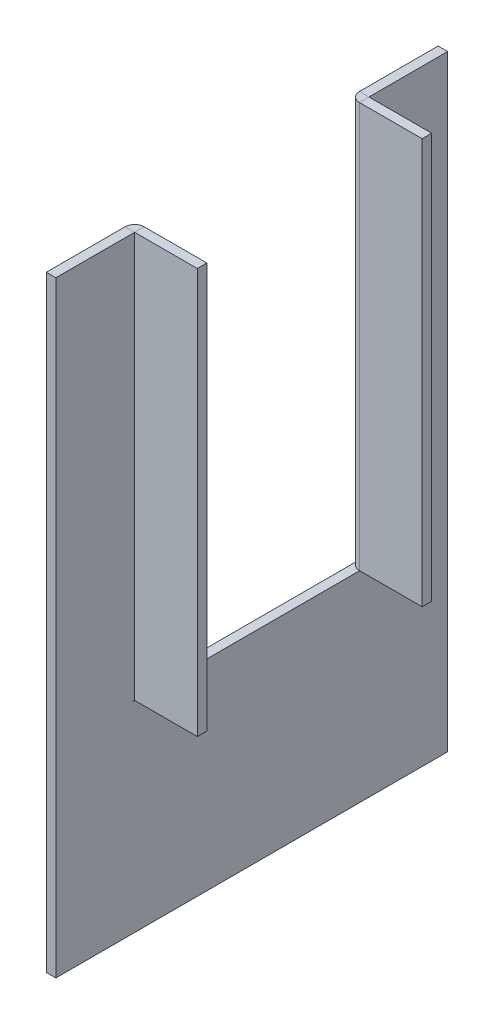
ISO-10303-21;
HEADER;
FILE_DESCRIPTION(('STEP AP214'),'2;1');
FILE_NAME('part.step','',(''),(''),'','','');
FILE_SCHEMA(('AUTOMOTIVE_DESIGN { 1 0 10303 214 1 1 1 1 }'));
ENDSEC;
DATA;
#1=APPLICATION_CONTEXT('core data for automotive mechanical design processes');
#2=APPLICATION_PROTOCOL_DEFINITION('international standard','automotive_design',2000,#1);
#3=PRODUCT_CONTEXT('',#1,'mechanical');
#4=PRODUCT('Part','Part','',(#3));
#5=PRODUCT_RELATED_PRODUCT_CATEGORY('part','',(#4));
#6=PRODUCT_DEFINITION_FORMATION('','',#4);
#7=PRODUCT_DEFINITION_CONTEXT('part definition',#1,'design');
#8=PRODUCT_DEFINITION('design','',#6,#7);
#9=PRODUCT_DEFINITION_SHAPE('','',#8);
#10=(LENGTH_UNIT() NAMED_UNIT(*) SI_UNIT(.MILLI.,.METRE.));
#11=(NAMED_UNIT(*) PLANE_ANGLE_UNIT() SI_UNIT($,.RADIAN.));
#12=(NAMED_UNIT(*) SI_UNIT($,.STERADIAN.) SOLID_ANGLE_UNIT());
#13=UNCERTAINTY_MEASURE_WITH_UNIT(LENGTH_MEASURE(1.E-05),#10,'distance_accuracy_value','');
#14=(GEOMETRIC_REPRESENTATION_CONTEXT(3) GLOBAL_UNCERTAINTY_ASSIGNED_CONTEXT((#13)) GLOBAL_UNIT_ASSIGNED_CONTEXT((#10,
#11,#12)) REPRESENTATION_CONTEXT('',''));
#15=CARTESIAN_POINT('',(0.,0.,0.));
#16=DIRECTION('',(0.,0.,1.));
#17=DIRECTION('',(1.,0.,0.));
#18=AXIS2_PLACEMENT_3D('',#15,#16,#17);
#19=CARTESIAN_POINT('',(-11.684,64.5983055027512,9.40547285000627));
#20=DIRECTION('',(0.,-1.,0.));
#21=DIRECTION('',(-1.,0.,0.));
#22=AXIS2_PLACEMENT_3D('',#19,#20,#21);
#23=PLANE('',#22);
#24=DIRECTION('',(0.,0.,1.));
#25=VECTOR('',#24,1.);
#26=CARTESIAN_POINT('',(-11.684,64.5983055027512,9.40547285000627));
#27=LINE('',#26,#25);
#28=CARTESIAN_POINT('',(-11.684,64.5983055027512,1.016));
#29=VERTEX_POINT('',#28);
#30=CARTESIAN_POINT('',(-11.684,64.5983055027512,9.40547285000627));
#31=VERTEX_POINT('',#30);
#32=EDGE_CURVE('E192',#29,#31,#27,.T.);
#33=ORIENTED_EDGE('',*,*,#32,.F.);
#34=DIRECTION('',(-1.,0.,0.));
#35=VECTOR('',#34,1.);
#36=CARTESIAN_POINT('',(-11.684,64.5983055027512,1.016));
#37=LINE('',#36,#35);
#38=CARTESIAN_POINT('',(-12.7,64.5983055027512,1.016));
#39=VERTEX_POINT('',#38);
#40=EDGE_CURVE('E12',#29,#39,#37,.T.);
#41=ORIENTED_EDGE('',*,*,#40,.T.);
#42=DIRECTION('',(0.,0.,1.));
#43=VECTOR('',#42,1.);
#44=CARTESIAN_POINT('',(-12.7,64.5983055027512,9.40547285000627));
#45=LINE('',#44,#43);
#46=CARTESIAN_POINT('',(-12.7,64.5983055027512,9.40547285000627));
#47=VERTEX_POINT('',#46);
#48=EDGE_CURVE('E198',#39,#47,#45,.T.);
#49=ORIENTED_EDGE('',*,*,#48,.T.);
#50=DIRECTION('',(-1.,0.,0.));
#51=VECTOR('',#50,1.);
#52=CARTESIAN_POINT('',(-11.684,64.5983055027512,9.40547285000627));
#53=LINE('',#52,#51);
#54=EDGE_CURVE('E245',#31,#47,#53,.T.);
#55=ORIENTED_EDGE('',*,*,#54,.F.);
#56=EDGE_LOOP('',(#33,#41,#49,#55));
#57=FACE_BOUND('',#56,.T.);
#58=ADVANCED_FACE('F39',(#57),#23,.F.);
#59=CARTESIAN_POINT('',(-11.684,21.4183055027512,-6.4645918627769));
#60=DIRECTION('',(0.,1.,0.));
#61=DIRECTION('',(1.,0.,0.));
#62=AXIS2_PLACEMENT_3D('',#59,#60,#61);
#63=PLANE('',#62);
#64=DIRECTION('',(0.,0.,-1.));
#65=VECTOR('',#64,1.);
#66=CARTESIAN_POINT('',(-12.7,21.4183055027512,-6.4645918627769));
#67=LINE('',#66,#65);
#68=CARTESIAN_POINT('',(-12.7,21.4183055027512,1.23403546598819));
#69=VERTEX_POINT('',#68);
#70=CARTESIAN_POINT('',(-12.7,21.4183055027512,1.01600000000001));
#71=VERTEX_POINT('',#70);
#72=EDGE_CURVE('E187',#69,#71,#67,.T.);
#73=ORIENTED_EDGE('',*,*,#72,.T.);
#74=DIRECTION('',(1.,0.,0.));
#75=VECTOR('',#74,1.);
#76=CARTESIAN_POINT('',(-11.684,21.4183055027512,1.016));
#77=LINE('',#76,#75);
#78=CARTESIAN_POINT('',(-11.684,21.4183055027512,1.016));
#79=VERTEX_POINT('',#78);
#80=EDGE_CURVE('E175',#71,#79,#77,.T.);
#81=ORIENTED_EDGE('',*,*,#80,.T.);
#82=DIRECTION('',(0.,0.,-1.));
#83=VECTOR('',#82,1.);
#84=CARTESIAN_POINT('',(-11.684,21.4183055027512,-6.4645918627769));
#85=LINE('',#84,#83);
#86=CARTESIAN_POINT('',(-11.684,21.4183055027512,1.23403546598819));
#87=VERTEX_POINT('',#86);
#88=EDGE_CURVE('E42',#87,#79,#85,.T.);
#89=ORIENTED_EDGE('',*,*,#88,.F.);
#90=DIRECTION('',(-1.,0.,0.));
#91=VECTOR('',#90,1.);
#92=CARTESIAN_POINT('',(-11.684,21.4183055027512,1.23403546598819));
#93=LINE('',#92,#91);
#94=EDGE_CURVE('E190',#87,#69,#93,.T.);
#95=ORIENTED_EDGE('',*,*,#94,.T.);
#96=EDGE_LOOP('',(#73,#81,#89,#95));
#97=FACE_BOUND('',#96,.T.);
#98=ADVANCED_FACE('F188',(#97),#63,.F.);
#99=CARTESIAN_POINT('',(-11.6840000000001,64.5983055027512,-32.3374019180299));
#100=DIRECTION('',(-1.,0.,0.));
#101=DIRECTION('',(0.,0.,1.));
#102=AXIS2_PLACEMENT_3D('',#99,#100,#101);
#103=PLANE('',#102);
#104=ORIENTED_EDGE('',*,*,#88,.T.);
#105=DIRECTION('',(0.,1.,0.));
#106=VECTOR('',#105,1.);
#107=CARTESIAN_POINT('',(-11.684,64.5983055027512,1.016));
#108=LINE('',#107,#106);
#109=EDGE_CURVE('E321',#79,#29,#108,.T.);
#110=ORIENTED_EDGE('',*,*,#109,.T.);
#111=ORIENTED_EDGE('',*,*,#32,.T.);
#112=DIRECTION('',(0.,-1.,0.));
#113=VECTOR('',#112,1.);
#114=CARTESIAN_POINT('',(-11.684,64.5983055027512,9.40547285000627));
#115=LINE('',#114,#113);
#116=CARTESIAN_POINT('',(-11.684,0.,9.40547285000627));
#117=VERTEX_POINT('',#116);
#118=EDGE_CURVE('E204',#31,#117,#115,.T.);
#119=ORIENTED_EDGE('',*,*,#118,.T.);
#120=DIRECTION('',(0.,0.,-1.));
#121=VECTOR('',#120,1.);
#122=CARTESIAN_POINT('',(-11.684,0.,9.40547285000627));
#123=LINE('',#122,#121);
#124=CARTESIAN_POINT('',(-11.6840000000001,0.,-32.3374019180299));
#125=VERTEX_POINT('',#124);
#126=EDGE_CURVE('E209',#117,#125,#123,.T.);
#127=ORIENTED_EDGE('',*,*,#126,.T.);
#128=DIRECTION('',(0.,1.,0.));
#129=VECTOR('',#128,1.);
#130=CARTESIAN_POINT('',(-11.6840000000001,64.5983055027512,-32.3374019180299));
#131=LINE('',#130,#129);
#132=CARTESIAN_POINT('',(-11.6840000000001,64.5983055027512,-32.3374019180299));
#133=VERTEX_POINT('',#132);
#134=EDGE_CURVE('E212',#125,#133,#131,.T.);
#135=ORIENTED_EDGE('',*,*,#134,.T.);
#136=DIRECTION('',(0.,0.,1.));
#137=VECTOR('',#136,1.);
#138=CARTESIAN_POINT('',(-11.6840000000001,64.5983055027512,-32.3374019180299));
#139=LINE('',#138,#137);
#140=CARTESIAN_POINT('',(-11.6840000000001,64.5983055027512,-23.9479290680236));
#141=VERTEX_POINT('',#140);
#142=EDGE_CURVE('E218',#133,#141,#139,.T.);
#143=ORIENTED_EDGE('',*,*,#142,.T.);
#144=DIRECTION('',(0.,1.,0.));
#145=VECTOR('',#144,1.);
#146=CARTESIAN_POINT('',(-11.6840000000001,64.5983055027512,-23.9479290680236));
#147=LINE('',#146,#145);
#148=CARTESIAN_POINT('',(-11.6840000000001,21.4183055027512,-23.9479290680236));
#149=VERTEX_POINT('',#148);
#150=EDGE_CURVE('E248',#149,#141,#147,.T.);
#151=ORIENTED_EDGE('',*,*,#150,.F.);
#152=DIRECTION('',(0.,0.,-1.));
#153=VECTOR('',#152,1.);
#154=CARTESIAN_POINT('',(-11.6840000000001,21.4183055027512,-16.4673372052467));
#155=LINE('',#154,#153);
#156=CARTESIAN_POINT('',(-11.6840000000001,21.4183055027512,-24.1659645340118));
#157=VERTEX_POINT('',#156);
#158=EDGE_CURVE('E222',#149,#157,#155,.T.);
#159=ORIENTED_EDGE('',*,*,#158,.T.);
#160=DIRECTION('',(0.,-1.,1.36592399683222E-13));
#161=VECTOR('',#160,1.);
#162=CARTESIAN_POINT('',(-11.6840000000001,21.4183055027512,-24.1659645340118));
#163=LINE('',#162,#161);
#164=CARTESIAN_POINT('',(-11.6840000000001,21.3929055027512,-24.1659645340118));
#165=VERTEX_POINT('',#164);
#166=EDGE_CURVE('E219',#157,#165,#163,.T.);
#167=ORIENTED_EDGE('',*,*,#166,.T.);
#168=DIRECTION('',(0.,0.,1.));
#169=VECTOR('',#168,1.);
#170=CARTESIAN_POINT('',(-11.684,21.3929055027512,1.23403546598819));
#171=LINE('',#170,#169);
#172=CARTESIAN_POINT('',(-11.684,21.3929055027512,1.23403546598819));
#173=VERTEX_POINT('',#172);
#174=EDGE_CURVE('E221',#165,#173,#171,.T.);
#175=ORIENTED_EDGE('',*,*,#174,.T.);
#176=DIRECTION('',(0.,1.,1.36592399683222E-13));
#177=VECTOR('',#176,1.);
#178=CARTESIAN_POINT('',(-11.684,21.4183055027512,1.23403546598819));
#179=LINE('',#178,#177);
#180=EDGE_CURVE('E224',#173,#87,#179,.T.);
#181=ORIENTED_EDGE('',*,*,#180,.T.);
#182=EDGE_LOOP('',(#104,#110,#111,#119,#127,#135,#143,#151,#159,#167,#175,#181));
#183=FACE_BOUND('',#182,.T.);
#184=ADVANCED_FACE('F265',(#183),#103,.F.);
#185=CARTESIAN_POINT('',(-12.7000000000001,64.5983055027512,-32.3374019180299));
#186=DIRECTION('',(-1.,0.,0.));
#187=DIRECTION('',(0.,0.,1.));
#188=AXIS2_PLACEMENT_3D('',#185,#186,#187);
#189=PLANE('',#188);
#190=DIRECTION('',(0.,1.,0.));
#191=VECTOR('',#190,1.);
#192=CARTESIAN_POINT('',(-12.7,64.5983055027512,1.016));
#193=LINE('',#192,#191);
#194=EDGE_CURVE('E47',#71,#39,#193,.T.);
#195=ORIENTED_EDGE('',*,*,#194,.F.);
#196=ORIENTED_EDGE('',*,*,#72,.F.);
#197=DIRECTION('',(0.,1.,1.36592399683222E-13));
#198=VECTOR('',#197,1.);
#199=CARTESIAN_POINT('',(-12.7,21.4183055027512,1.23403546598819));
#200=LINE('',#199,#198);
#201=CARTESIAN_POINT('',(-12.7,21.3929055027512,1.23403546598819));
#202=VERTEX_POINT('',#201);
#203=EDGE_CURVE('E193',#202,#69,#200,.T.);
#204=ORIENTED_EDGE('',*,*,#203,.F.);
#205=DIRECTION('',(0.,0.,1.));
#206=VECTOR('',#205,1.);
#207=CARTESIAN_POINT('',(-12.7,21.3929055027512,1.23403546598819));
#208=LINE('',#207,#206);
#209=CARTESIAN_POINT('',(-12.7000000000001,21.3929055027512,-24.1659645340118));
#210=VERTEX_POINT('',#209);
#211=EDGE_CURVE('E280',#210,#202,#208,.T.);
#212=ORIENTED_EDGE('',*,*,#211,.F.);
#213=DIRECTION('',(0.,-1.,1.36592399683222E-13));
#214=VECTOR('',#213,1.);
#215=CARTESIAN_POINT('',(-12.7000000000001,21.4183055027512,-24.1659645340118));
#216=LINE('',#215,#214);
#217=CARTESIAN_POINT('',(-12.7000000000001,21.4183055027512,-24.1659645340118));
#218=VERTEX_POINT('',#217);
#219=EDGE_CURVE('E259',#218,#210,#216,.T.);
#220=ORIENTED_EDGE('',*,*,#219,.F.);
#221=DIRECTION('',(0.,0.,-1.));
#222=VECTOR('',#221,1.);
#223=CARTESIAN_POINT('',(-12.7000000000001,21.4183055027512,-16.4673372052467));
#224=LINE('',#223,#222);
#225=CARTESIAN_POINT('',(-12.7000000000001,21.4183055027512,-23.9479290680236));
#226=VERTEX_POINT('',#225);
#227=EDGE_CURVE('E62',#226,#218,#224,.T.);
#228=ORIENTED_EDGE('',*,*,#227,.F.);
#229=DIRECTION('',(0.,1.,0.));
#230=VECTOR('',#229,1.);
#231=CARTESIAN_POINT('',(-12.7000000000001,64.5983055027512,-23.9479290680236));
#232=LINE('',#231,#230);
#233=CARTESIAN_POINT('',(-12.7000000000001,64.5983055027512,-23.9479290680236));
#234=VERTEX_POINT('',#233);
#235=EDGE_CURVE('E254',#226,#234,#232,.T.);
#236=ORIENTED_EDGE('',*,*,#235,.T.);
#237=DIRECTION('',(0.,0.,1.));
#238=VECTOR('',#237,1.);
#239=CARTESIAN_POINT('',(-12.7000000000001,64.5983055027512,-32.3374019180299));
#240=LINE('',#239,#238);
#241=CARTESIAN_POINT('',(-12.7000000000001,64.5983055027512,-32.3374019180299));
#242=VERTEX_POINT('',#241);
#243=EDGE_CURVE('E260',#242,#234,#240,.T.);
#244=ORIENTED_EDGE('',*,*,#243,.F.);
#245=DIRECTION('',(0.,1.,0.));
#246=VECTOR('',#245,1.);
#247=CARTESIAN_POINT('',(-12.7000000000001,64.5983055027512,-32.3374019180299));
#248=LINE('',#247,#246);
#249=CARTESIAN_POINT('',(-12.7000000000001,0.,-32.3374019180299));
#250=VERTEX_POINT('',#249);
#251=EDGE_CURVE('E262',#250,#242,#248,.T.);
#252=ORIENTED_EDGE('',*,*,#251,.F.);
#253=DIRECTION('',(0.,0.,-1.));
#254=VECTOR('',#253,1.);
#255=CARTESIAN_POINT('',(-12.7,0.,9.40547285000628));
#256=LINE('',#255,#254);
#257=CARTESIAN_POINT('',(-12.7,0.,9.40547285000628));
#258=VERTEX_POINT('',#257);
#259=EDGE_CURVE('E284',#258,#250,#256,.T.);
#260=ORIENTED_EDGE('',*,*,#259,.F.);
#261=DIRECTION('',(0.,-1.,0.));
#262=VECTOR('',#261,1.);
#263=CARTESIAN_POINT('',(-12.7,64.5983055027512,9.40547285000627));
#264=LINE('',#263,#262);
#265=EDGE_CURVE('E202',#47,#258,#264,.T.);
#266=ORIENTED_EDGE('',*,*,#265,.F.);
#267=ORIENTED_EDGE('',*,*,#48,.F.);
#268=EDGE_LOOP('',(#195,#196,#204,#212,#220,#228,#236,#244,#252,#260,#266,#267));
#269=FACE_BOUND('',#268,.T.);
#270=ADVANCED_FACE('F196',(#269),#189,.T.);
#271=CARTESIAN_POINT('',(-11.684,64.5983055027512,9.40547285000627));
#272=DIRECTION('',(0.,0.,-1.));
#273=DIRECTION('',(0.,1.,0.));
#274=AXIS2_PLACEMENT_3D('',#271,#272,#273);
#275=PLANE('',#274);
#276=ORIENTED_EDGE('',*,*,#265,.T.);
#277=DIRECTION('',(-1.,0.,0.));
#278=VECTOR('',#277,1.);
#279=CARTESIAN_POINT('',(-11.684,0.,9.40547285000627));
#280=LINE('',#279,#278);
#281=EDGE_CURVE('E242',#117,#258,#280,.T.);
#282=ORIENTED_EDGE('',*,*,#281,.F.);
#283=ORIENTED_EDGE('',*,*,#118,.F.);
#284=ORIENTED_EDGE('',*,*,#54,.T.);
#285=EDGE_LOOP('',(#276,#282,#283,#284));
#286=FACE_BOUND('',#285,.T.);
#287=ADVANCED_FACE('F367',(#286),#275,.F.);
#288=CARTESIAN_POINT('',(-11.684,0.,9.40547285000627));
#289=DIRECTION('',(0.,1.,0.));
#290=DIRECTION('',(1.,0.,0.));
#291=AXIS2_PLACEMENT_3D('',#288,#289,#290);
#292=PLANE('',#291);
#293=ORIENTED_EDGE('',*,*,#259,.T.);
#294=DIRECTION('',(-1.,0.,0.));
#295=VECTOR('',#294,1.);
#296=CARTESIAN_POINT('',(-11.6840000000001,0.,-32.3374019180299));
#297=LINE('',#296,#295);
#298=EDGE_CURVE('E239',#125,#250,#297,.T.);
#299=ORIENTED_EDGE('',*,*,#298,.F.);
#300=ORIENTED_EDGE('',*,*,#126,.F.);
#301=ORIENTED_EDGE('',*,*,#281,.T.);
#302=EDGE_LOOP('',(#293,#299,#300,#301));
#303=FACE_BOUND('',#302,.T.);
#304=ADVANCED_FACE('F372',(#303),#292,.F.);
#305=CARTESIAN_POINT('',(-11.6840000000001,64.5983055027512,-32.3374019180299));
#306=DIRECTION('',(0.,0.,1.));
#307=DIRECTION('',(0.,-1.,0.));
#308=AXIS2_PLACEMENT_3D('',#305,#306,#307);
#309=PLANE('',#308);
#310=ORIENTED_EDGE('',*,*,#251,.T.);
#311=DIRECTION('',(-1.,0.,0.));
#312=VECTOR('',#311,1.);
#313=CARTESIAN_POINT('',(-11.6840000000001,64.5983055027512,-32.3374019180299));
#314=LINE('',#313,#312);
#315=EDGE_CURVE('E236',#133,#242,#314,.T.);
#316=ORIENTED_EDGE('',*,*,#315,.F.);
#317=ORIENTED_EDGE('',*,*,#134,.F.);
#318=ORIENTED_EDGE('',*,*,#298,.T.);
#319=EDGE_LOOP('',(#310,#316,#317,#318));
#320=FACE_BOUND('',#319,.T.);
#321=ADVANCED_FACE('F378',(#320),#309,.F.);
#322=CARTESIAN_POINT('',(-11.6840000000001,64.5983055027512,-32.3374019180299));
#323=DIRECTION('',(0.,-1.,0.));
#324=DIRECTION('',(-1.,0.,0.));
#325=AXIS2_PLACEMENT_3D('',#322,#323,#324);
#326=PLANE('',#325);
#327=DIRECTION('',(-1.,0.,0.));
#328=VECTOR('',#327,1.);
#329=CARTESIAN_POINT('',(-11.6840000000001,64.5983055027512,-23.9479290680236));
#330=LINE('',#329,#328);
#331=EDGE_CURVE('E251',#141,#234,#330,.T.);
#332=ORIENTED_EDGE('',*,*,#331,.F.);
#333=ORIENTED_EDGE('',*,*,#142,.F.);
#334=ORIENTED_EDGE('',*,*,#315,.T.);
#335=ORIENTED_EDGE('',*,*,#243,.T.);
#336=EDGE_LOOP('',(#332,#333,#334,#335));
#337=FACE_BOUND('',#336,.T.);
#338=ADVANCED_FACE('F382',(#337),#326,.F.);
#339=CARTESIAN_POINT('',(-11.6840000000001,21.4183055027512,-16.4673372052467));
#340=DIRECTION('',(0.,1.,0.));
#341=DIRECTION('',(1.,0.,0.));
#342=AXIS2_PLACEMENT_3D('',#339,#340,#341);
#343=PLANE('',#342);
#344=DIRECTION('',(1.,0.,0.));
#345=VECTOR('',#344,1.);
#346=CARTESIAN_POINT('',(-11.6840000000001,21.4183055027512,-23.9479290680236));
#347=LINE('',#346,#345);
#348=EDGE_CURVE('E183',#226,#149,#347,.T.);
#349=ORIENTED_EDGE('',*,*,#348,.F.);
#350=ORIENTED_EDGE('',*,*,#227,.T.);
#351=DIRECTION('',(-1.,0.,0.));
#352=VECTOR('',#351,1.);
#353=CARTESIAN_POINT('',(-11.6840000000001,21.4183055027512,-24.1659645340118));
#354=LINE('',#353,#352);
#355=EDGE_CURVE('E233',#157,#218,#354,.T.);
#356=ORIENTED_EDGE('',*,*,#355,.F.);
#357=ORIENTED_EDGE('',*,*,#158,.F.);
#358=EDGE_LOOP('',(#349,#350,#356,#357));
#359=FACE_BOUND('',#358,.T.);
#360=ADVANCED_FACE('F269',(#359),#343,.F.);
#361=CARTESIAN_POINT('',(-11.6840000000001,21.4183055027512,-24.1659645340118));
#362=DIRECTION('',(0.,-1.36592399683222E-13,-1.));
#363=DIRECTION('',(0.,1.,-1.36592399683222E-13));
#364=AXIS2_PLACEMENT_3D('',#361,#362,#363);
#365=PLANE('',#364);
#366=ORIENTED_EDGE('',*,*,#219,.T.);
#367=DIRECTION('',(-1.,0.,0.));
#368=VECTOR('',#367,1.);
#369=CARTESIAN_POINT('',(-11.6840000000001,21.3929055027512,-24.1659645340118));
#370=LINE('',#369,#368);
#371=EDGE_CURVE('E230',#165,#210,#370,.T.);
#372=ORIENTED_EDGE('',*,*,#371,.F.);
#373=ORIENTED_EDGE('',*,*,#166,.F.);
#374=ORIENTED_EDGE('',*,*,#355,.T.);
#375=EDGE_LOOP('',(#366,#372,#373,#374));
#376=FACE_BOUND('',#375,.T.);
#377=ADVANCED_FACE('F271',(#376),#365,.F.);
#378=CARTESIAN_POINT('',(-11.684,21.3929055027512,1.23403546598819));
#379=DIRECTION('',(0.,-1.,0.));
#380=DIRECTION('',(-1.,0.,0.));
#381=AXIS2_PLACEMENT_3D('',#378,#379,#380);
#382=PLANE('',#381);
#383=ORIENTED_EDGE('',*,*,#211,.T.);
#384=DIRECTION('',(-1.,0.,0.));
#385=VECTOR('',#384,1.);
#386=CARTESIAN_POINT('',(-11.684,21.3929055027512,1.23403546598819));
#387=LINE('',#386,#385);
#388=EDGE_CURVE('E227',#173,#202,#387,.T.);
#389=ORIENTED_EDGE('',*,*,#388,.F.);
#390=ORIENTED_EDGE('',*,*,#174,.F.);
#391=ORIENTED_EDGE('',*,*,#371,.T.);
#392=EDGE_LOOP('',(#383,#389,#390,#391));
#393=FACE_BOUND('',#392,.T.);
#394=ADVANCED_FACE('F276',(#393),#382,.F.);
#395=CARTESIAN_POINT('',(-11.684,21.4183055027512,1.23403546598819));
#396=DIRECTION('',(0.,-1.36592399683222E-13,1.));
#397=DIRECTION('',(0.,-1.,-1.36592399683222E-13));
#398=AXIS2_PLACEMENT_3D('',#395,#396,#397);
#399=PLANE('',#398);
#400=ORIENTED_EDGE('',*,*,#203,.T.);
#401=ORIENTED_EDGE('',*,*,#94,.F.);
#402=ORIENTED_EDGE('',*,*,#180,.F.);
#403=ORIENTED_EDGE('',*,*,#388,.T.);
#404=EDGE_LOOP('',(#400,#401,#402,#403));
#405=FACE_BOUND('',#404,.T.);
#406=ADVANCED_FACE('F279',(#405),#399,.F.);
#407=CARTESIAN_POINT('',(-11.6840000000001,64.5983055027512,-23.9479290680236));
#408=DIRECTION('',(0.,-1.,0.));
#409=DIRECTION('',(0.,0.,-1.));
#410=AXIS2_PLACEMENT_3D('',#407,#408,#409);
#411=PLANE('',#410);
#412=CARTESIAN_POINT('',(-11.6840000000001,64.5983055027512,-23.9479290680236));
#413=DIRECTION('',(0.,-1.,0.));
#414=DIRECTION('',(0.,0.,-1.));
#415=AXIS2_PLACEMENT_3D('',#412,#413,#414);
#416=CIRCLE('',#415,1.016);
#417=CARTESIAN_POINT('',(-11.6840000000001,64.5983055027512,-22.9319290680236));
#418=VERTEX_POINT('',#417);
#419=EDGE_CURVE('E203',#418,#234,#416,.T.);
#420=ORIENTED_EDGE('',*,*,#419,.F.);
#421=DIRECTION('',(0.,0.,1.));
#422=VECTOR('',#421,1.);
#423=CARTESIAN_POINT('',(-11.6840000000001,64.5983055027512,-23.9479290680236));
#424=LINE('',#423,#422);
#425=EDGE_CURVE('E308',#141,#418,#424,.T.);
#426=ORIENTED_EDGE('',*,*,#425,.F.);
#427=ORIENTED_EDGE('',*,*,#331,.T.);
#428=EDGE_LOOP('',(#420,#426,#427));
#429=FACE_BOUND('',#428,.T.);
#430=ADVANCED_FACE('F386',(#429),#411,.F.);
#431=CARTESIAN_POINT('',(-11.6840000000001,21.4183055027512,-23.9479290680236));
#432=DIRECTION('',(0.,-1.,0.));
#433=DIRECTION('',(0.,0.,-1.));
#434=AXIS2_PLACEMENT_3D('',#431,#432,#433);
#435=CYLINDRICAL_SURFACE('',#434,1.016);
#436=CARTESIAN_POINT('',(-11.6840000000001,21.4183055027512,-23.9479290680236));
#437=DIRECTION('',(0.,-1.,0.));
#438=DIRECTION('',(0.,0.,-1.));
#439=AXIS2_PLACEMENT_3D('',#436,#437,#438);
#440=CIRCLE('',#439,1.016);
#441=CARTESIAN_POINT('',(-11.6840000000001,21.4183055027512,-22.9319290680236));
#442=VERTEX_POINT('',#441);
#443=EDGE_CURVE('E289',#442,#226,#440,.T.);
#444=ORIENTED_EDGE('',*,*,#443,.F.);
#445=DIRECTION('',(0.,1.,0.));
#446=VECTOR('',#445,1.);
#447=CARTESIAN_POINT('',(-11.6840000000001,64.5983055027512,-22.9319290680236));
#448=LINE('',#447,#446);
#449=EDGE_CURVE('E293',#442,#418,#448,.T.);
#450=ORIENTED_EDGE('',*,*,#449,.T.);
#451=ORIENTED_EDGE('',*,*,#419,.T.);
#452=ORIENTED_EDGE('',*,*,#235,.F.);
#453=EDGE_LOOP('',(#444,#450,#451,#452));
#454=FACE_BOUND('',#453,.T.);
#455=ADVANCED_FACE('F409',(#454),#435,.T.);
#456=CARTESIAN_POINT('',(-11.6840000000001,21.4183055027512,-23.9479290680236));
#457=DIRECTION('',(0.,1.,0.));
#458=DIRECTION('',(0.,0.,1.));
#459=AXIS2_PLACEMENT_3D('',#456,#457,#458);
#460=PLANE('',#459);
#461=DIRECTION('',(0.,0.,-1.));
#462=VECTOR('',#461,1.);
#463=CARTESIAN_POINT('',(-11.6840000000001,21.4183055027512,-23.9479290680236));
#464=LINE('',#463,#462);
#465=EDGE_CURVE('E316',#442,#149,#464,.T.);
#466=ORIENTED_EDGE('',*,*,#465,.F.);
#467=ORIENTED_EDGE('',*,*,#443,.T.);
#468=ORIENTED_EDGE('',*,*,#348,.T.);
#469=EDGE_LOOP('',(#466,#467,#468));
#470=FACE_BOUND('',#469,.T.);
#471=ADVANCED_FACE('F406',(#470),#460,.F.);
#472=CARTESIAN_POINT('',(-5.00137267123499,64.5983055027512,-23.9479290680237));
#473=DIRECTION('',(-1.,0.,0.));
#474=DIRECTION('',(0.,1.,0.));
#475=AXIS2_PLACEMENT_3D('',#472,#473,#474);
#476=PLANE('',#475);
#477=DIRECTION('',(0.,-1.,0.));
#478=VECTOR('',#477,1.);
#479=CARTESIAN_POINT('',(-5.00137267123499,64.5983055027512,-22.9319290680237));
#480=LINE('',#479,#478);
#481=CARTESIAN_POINT('',(-5.00137267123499,64.5983055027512,-22.9319290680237));
#482=VERTEX_POINT('',#481);
#483=CARTESIAN_POINT('',(-5.00137267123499,21.4183055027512,-22.9319290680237));
#484=VERTEX_POINT('',#483);
#485=EDGE_CURVE('E295',#482,#484,#480,.T.);
#486=ORIENTED_EDGE('',*,*,#485,.T.);
#487=DIRECTION('',(0.,0.,1.));
#488=VECTOR('',#487,1.);
#489=CARTESIAN_POINT('',(-5.001372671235,21.4183055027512,-23.9479290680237));
#490=LINE('',#489,#488);
#491=CARTESIAN_POINT('',(-5.001372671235,21.4183055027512,-23.9479290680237));
#492=VERTEX_POINT('',#491);
#493=EDGE_CURVE('E292',#492,#484,#490,.T.);
#494=ORIENTED_EDGE('',*,*,#493,.F.);
#495=DIRECTION('',(0.,-1.,0.));
#496=VECTOR('',#495,1.);
#497=CARTESIAN_POINT('',(-5.00137267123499,64.5983055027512,-23.9479290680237));
#498=LINE('',#497,#496);
#499=CARTESIAN_POINT('',(-5.00137267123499,64.5983055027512,-23.9479290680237));
#500=VERTEX_POINT('',#499);
#501=EDGE_CURVE('E306',#500,#492,#498,.T.);
#502=ORIENTED_EDGE('',*,*,#501,.F.);
#503=DIRECTION('',(0.,0.,1.));
#504=VECTOR('',#503,1.);
#505=CARTESIAN_POINT('',(-5.00137267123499,64.5983055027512,-23.9479290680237));
#506=LINE('',#505,#504);
#507=EDGE_CURVE('E298',#500,#482,#506,.T.);
#508=ORIENTED_EDGE('',*,*,#507,.T.);
#509=EDGE_LOOP('',(#486,#494,#502,#508));
#510=FACE_BOUND('',#509,.T.);
#511=ADVANCED_FACE('F399',(#510),#476,.F.);
#512=CARTESIAN_POINT('',(-20.8714373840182,64.5983055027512,-23.9479290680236));
#513=DIRECTION('',(0.,0.,1.));
#514=DIRECTION('',(1.,0.,0.));
#515=AXIS2_PLACEMENT_3D('',#512,#513,#514);
#516=PLANE('',#515);
#517=DIRECTION('',(-1.,0.,0.));
#518=VECTOR('',#517,1.);
#519=CARTESIAN_POINT('',(-5.001372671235,21.4183055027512,-23.9479290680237));
#520=LINE('',#519,#518);
#521=EDGE_CURVE('E301',#492,#149,#520,.T.);
#522=ORIENTED_EDGE('',*,*,#521,.T.);
#523=ORIENTED_EDGE('',*,*,#150,.T.);
#524=DIRECTION('',(1.,0.,0.));
#525=VECTOR('',#524,1.);
#526=CARTESIAN_POINT('',(-20.8714373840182,64.5983055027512,-23.9479290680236));
#527=LINE('',#526,#525);
#528=EDGE_CURVE('E304',#141,#500,#527,.T.);
#529=ORIENTED_EDGE('',*,*,#528,.T.);
#530=ORIENTED_EDGE('',*,*,#501,.T.);
#531=EDGE_LOOP('',(#522,#523,#529,#530));
#532=FACE_BOUND('',#531,.T.);
#533=ADVANCED_FACE('F391',(#532),#516,.F.);
#534=CARTESIAN_POINT('',(-20.8714373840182,64.5983055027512,-23.9479290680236));
#535=DIRECTION('',(0.,-1.,0.));
#536=DIRECTION('',(0.,0.,1.));
#537=AXIS2_PLACEMENT_3D('',#534,#535,#536);
#538=PLANE('',#537);
#539=ORIENTED_EDGE('',*,*,#528,.F.);
#540=ORIENTED_EDGE('',*,*,#425,.T.);
#541=DIRECTION('',(1.,0.,0.));
#542=VECTOR('',#541,1.);
#543=CARTESIAN_POINT('',(-20.8714373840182,64.5983055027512,-22.9319290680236));
#544=LINE('',#543,#542);
#545=EDGE_CURVE('E311',#418,#482,#544,.T.);
#546=ORIENTED_EDGE('',*,*,#545,.T.);
#547=ORIENTED_EDGE('',*,*,#507,.F.);
#548=EDGE_LOOP('',(#539,#540,#546,#547));
#549=FACE_BOUND('',#548,.T.);
#550=ADVANCED_FACE('F394',(#549),#538,.F.);
#551=CARTESIAN_POINT('',(-20.8714373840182,64.5983055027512,-22.9319290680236));
#552=DIRECTION('',(0.,0.,1.));
#553=DIRECTION('',(1.,0.,0.));
#554=AXIS2_PLACEMENT_3D('',#551,#552,#553);
#555=PLANE('',#554);
#556=ORIENTED_EDGE('',*,*,#449,.F.);
#557=DIRECTION('',(-1.,0.,0.));
#558=VECTOR('',#557,1.);
#559=CARTESIAN_POINT('',(-5.00137267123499,21.4183055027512,-22.9319290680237));
#560=LINE('',#559,#558);
#561=EDGE_CURVE('E313',#484,#442,#560,.T.);
#562=ORIENTED_EDGE('',*,*,#561,.F.);
#563=ORIENTED_EDGE('',*,*,#485,.F.);
#564=ORIENTED_EDGE('',*,*,#545,.F.);
#565=EDGE_LOOP('',(#556,#562,#563,#564));
#566=FACE_BOUND('',#565,.T.);
#567=ADVANCED_FACE('F411',(#566),#555,.T.);
#568=CARTESIAN_POINT('',(-5.001372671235,21.4183055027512,-23.9479290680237));
#569=DIRECTION('',(0.,1.,0.));
#570=DIRECTION('',(0.,0.,-1.));
#571=AXIS2_PLACEMENT_3D('',#568,#569,#570);
#572=PLANE('',#571);
#573=ORIENTED_EDGE('',*,*,#561,.T.);
#574=ORIENTED_EDGE('',*,*,#465,.T.);
#575=ORIENTED_EDGE('',*,*,#521,.F.);
#576=ORIENTED_EDGE('',*,*,#493,.T.);
#577=EDGE_LOOP('',(#573,#574,#575,#576));
#578=FACE_BOUND('',#577,.T.);
#579=ADVANCED_FACE('F402',(#578),#572,.F.);
#580=CARTESIAN_POINT('',(-5.00137267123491,64.5983055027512,1.016));
#581=DIRECTION('',(-1.,0.,0.));
#582=DIRECTION('',(0.,-1.,0.));
#583=AXIS2_PLACEMENT_3D('',#580,#581,#582);
#584=PLANE('',#583);
#585=DIRECTION('',(0.,1.,0.));
#586=VECTOR('',#585,1.);
#587=CARTESIAN_POINT('',(-5.00137267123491,64.5983055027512,0.));
#588=LINE('',#587,#586);
#589=CARTESIAN_POINT('',(-5.00137267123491,21.4183055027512,0.));
#590=VERTEX_POINT('',#589);
#591=CARTESIAN_POINT('',(-5.00137267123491,64.5983055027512,0.));
#592=VERTEX_POINT('',#591);
#593=EDGE_CURVE('E327',#590,#592,#588,.T.);
#594=ORIENTED_EDGE('',*,*,#593,.T.);
#595=DIRECTION('',(0.,0.,-1.));
#596=VECTOR('',#595,1.);
#597=CARTESIAN_POINT('',(-5.00137267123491,64.5983055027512,1.016));
#598=LINE('',#597,#596);
#599=CARTESIAN_POINT('',(-5.00137267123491,64.5983055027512,1.016));
#600=VERTEX_POINT('',#599);
#601=EDGE_CURVE('E341',#600,#592,#598,.T.);
#602=ORIENTED_EDGE('',*,*,#601,.F.);
#603=DIRECTION('',(0.,1.,0.));
#604=VECTOR('',#603,1.);
#605=CARTESIAN_POINT('',(-5.00137267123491,64.5983055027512,1.016));
#606=LINE('',#605,#604);
#607=CARTESIAN_POINT('',(-5.00137267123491,21.4183055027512,1.016));
#608=VERTEX_POINT('',#607);
#609=EDGE_CURVE('E334',#608,#600,#606,.T.);
#610=ORIENTED_EDGE('',*,*,#609,.F.);
#611=DIRECTION('',(0.,0.,-1.));
#612=VECTOR('',#611,1.);
#613=CARTESIAN_POINT('',(-5.00137267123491,21.4183055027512,1.016));
#614=LINE('',#613,#612);
#615=EDGE_CURVE('E329',#608,#590,#614,.T.);
#616=ORIENTED_EDGE('',*,*,#615,.T.);
#617=EDGE_LOOP('',(#594,#602,#610,#616));
#618=FACE_BOUND('',#617,.T.);
#619=ADVANCED_FACE('F418',(#618),#584,.F.);
#620=CARTESIAN_POINT('',(20.8714373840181,64.5983055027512,1.016));
#621=DIRECTION('',(0.,0.,-1.));
#622=DIRECTION('',(-1.,0.,0.));
#623=AXIS2_PLACEMENT_3D('',#620,#621,#622);
#624=PLANE('',#623);
#625=ORIENTED_EDGE('',*,*,#109,.F.);
#626=DIRECTION('',(1.,0.,0.));
#627=VECTOR('',#626,1.);
#628=CARTESIAN_POINT('',(-5.00137267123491,21.4183055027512,1.016));
#629=LINE('',#628,#627);
#630=EDGE_CURVE('E332',#79,#608,#629,.T.);
#631=ORIENTED_EDGE('',*,*,#630,.T.);
#632=ORIENTED_EDGE('',*,*,#609,.T.);
#633=DIRECTION('',(-1.,0.,0.));
#634=VECTOR('',#633,1.);
#635=CARTESIAN_POINT('',(-20.8714373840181,64.5983055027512,1.016));
#636=LINE('',#635,#634);
#637=EDGE_CURVE('E336',#600,#29,#636,.T.);
#638=ORIENTED_EDGE('',*,*,#637,.T.);
#639=EDGE_LOOP('',(#625,#631,#632,#638));
#640=FACE_BOUND('',#639,.T.);
#641=ADVANCED_FACE('F363',(#640),#624,.F.);
#642=CARTESIAN_POINT('',(-5.00137267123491,21.4183055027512,1.016));
#643=DIRECTION('',(0.,1.,0.));
#644=DIRECTION('',(0.,0.,1.));
#645=AXIS2_PLACEMENT_3D('',#642,#643,#644);
#646=PLANE('',#645);
#647=DIRECTION('',(0.,0.,1.));
#648=VECTOR('',#647,1.);
#649=CARTESIAN_POINT('',(-11.684,21.4183055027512,1.016));
#650=LINE('',#649,#648);
#651=CARTESIAN_POINT('',(-11.684,21.4183055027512,0.));
#652=VERTEX_POINT('',#651);
#653=EDGE_CURVE('E179',#652,#79,#650,.T.);
#654=ORIENTED_EDGE('',*,*,#653,.F.);
#655=DIRECTION('',(1.,0.,0.));
#656=VECTOR('',#655,1.);
#657=CARTESIAN_POINT('',(-5.00137267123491,21.4183055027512,0.));
#658=LINE('',#657,#656);
#659=EDGE_CURVE('E338',#652,#590,#658,.T.);
#660=ORIENTED_EDGE('',*,*,#659,.T.);
#661=ORIENTED_EDGE('',*,*,#615,.F.);
#662=ORIENTED_EDGE('',*,*,#630,.F.);
#663=EDGE_LOOP('',(#654,#660,#661,#662));
#664=FACE_BOUND('',#663,.T.);
#665=ADVANCED_FACE('F359',(#664),#646,.F.);
#666=CARTESIAN_POINT('',(20.8714373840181,64.5983055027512,0.));
#667=DIRECTION('',(0.,0.,-1.));
#668=DIRECTION('',(-1.,0.,0.));
#669=AXIS2_PLACEMENT_3D('',#666,#667,#668);
#670=PLANE('',#669);
#671=ORIENTED_EDGE('',*,*,#659,.F.);
#672=DIRECTION('',(0.,1.,0.));
#673=VECTOR('',#672,1.);
#674=CARTESIAN_POINT('',(-11.684,64.5983055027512,0.));
#675=LINE('',#674,#673);
#676=CARTESIAN_POINT('',(-11.684,64.5983055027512,0.));
#677=VERTEX_POINT('',#676);
#678=EDGE_CURVE('E169',#652,#677,#675,.T.);
#679=ORIENTED_EDGE('',*,*,#678,.T.);
#680=DIRECTION('',(-1.,0.,0.));
#681=VECTOR('',#680,1.);
#682=CARTESIAN_POINT('',(-20.8714373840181,64.5983055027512,0.));
#683=LINE('',#682,#681);
#684=EDGE_CURVE('E296',#592,#677,#683,.T.);
#685=ORIENTED_EDGE('',*,*,#684,.F.);
#686=ORIENTED_EDGE('',*,*,#593,.F.);
#687=EDGE_LOOP('',(#671,#679,#685,#686));
#688=FACE_BOUND('',#687,.T.);
#689=ADVANCED_FACE('F356',(#688),#670,.T.);
#690=CARTESIAN_POINT('',(-20.8714373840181,64.5983055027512,1.016));
#691=DIRECTION('',(0.,-1.,0.));
#692=DIRECTION('',(0.,0.,-1.));
#693=AXIS2_PLACEMENT_3D('',#690,#691,#692);
#694=PLANE('',#693);
#695=DIRECTION('',(0.,0.,-1.));
#696=VECTOR('',#695,1.);
#697=CARTESIAN_POINT('',(-11.684,64.5983055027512,1.016));
#698=LINE('',#697,#696);
#699=EDGE_CURVE('E323',#29,#677,#698,.T.);
#700=ORIENTED_EDGE('',*,*,#699,.F.);
#701=ORIENTED_EDGE('',*,*,#637,.F.);
#702=ORIENTED_EDGE('',*,*,#601,.T.);
#703=ORIENTED_EDGE('',*,*,#684,.T.);
#704=EDGE_LOOP('',(#700,#701,#702,#703));
#705=FACE_BOUND('',#704,.T.);
#706=ADVANCED_FACE('F351',(#705),#694,.F.);
#707=CARTESIAN_POINT('',(-11.684,64.5983055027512,1.016));
#708=DIRECTION('',(0.,-1.,0.));
#709=DIRECTION('',(1.,0.,0.));
#710=AXIS2_PLACEMENT_3D('',#707,#708,#709);
#711=PLANE('',#710);
#712=CARTESIAN_POINT('',(-11.684,64.5983055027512,1.016));
#713=DIRECTION('',(0.,-1.,0.));
#714=DIRECTION('',(1.,0.,0.));
#715=AXIS2_PLACEMENT_3D('',#712,#713,#714);
#716=CIRCLE('',#715,1.016);
#717=EDGE_CURVE('E172',#39,#677,#716,.T.);
#718=ORIENTED_EDGE('',*,*,#717,.F.);
#719=ORIENTED_EDGE('',*,*,#40,.F.);
#720=ORIENTED_EDGE('',*,*,#699,.T.);
#721=EDGE_LOOP('',(#718,#719,#720));
#722=FACE_BOUND('',#721,.T.);
#723=ADVANCED_FACE('F348',(#722),#711,.F.);
#724=CARTESIAN_POINT('',(-11.684,21.4183055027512,1.016));
#725=DIRECTION('',(0.,-1.,0.));
#726=DIRECTION('',(1.,0.,0.));
#727=AXIS2_PLACEMENT_3D('',#724,#725,#726);
#728=CYLINDRICAL_SURFACE('',#727,1.016);
#729=CARTESIAN_POINT('',(-11.684,21.4183055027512,1.016));
#730=DIRECTION('',(0.,-1.,0.));
#731=DIRECTION('',(1.,0.,0.));
#732=AXIS2_PLACEMENT_3D('',#729,#730,#731);
#733=CIRCLE('',#732,1.016);
#734=EDGE_CURVE('E165',#71,#652,#733,.T.);
#735=ORIENTED_EDGE('',*,*,#734,.F.);
#736=ORIENTED_EDGE('',*,*,#194,.T.);
#737=ORIENTED_EDGE('',*,*,#717,.T.);
#738=ORIENTED_EDGE('',*,*,#678,.F.);
#739=EDGE_LOOP('',(#735,#736,#737,#738));
#740=FACE_BOUND('',#739,.T.);
#741=ADVANCED_FACE('F167',(#740),#728,.T.);
#742=CARTESIAN_POINT('',(-11.684,21.4183055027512,1.016));
#743=DIRECTION('',(0.,1.,0.));
#744=DIRECTION('',(-1.,0.,0.));
#745=AXIS2_PLACEMENT_3D('',#742,#743,#744);
#746=PLANE('',#745);
#747=ORIENTED_EDGE('',*,*,#80,.F.);
#748=ORIENTED_EDGE('',*,*,#734,.T.);
#749=ORIENTED_EDGE('',*,*,#653,.T.);
#750=EDGE_LOOP('',(#747,#748,#749));
#751=FACE_BOUND('',#750,.T.);
#752=ADVANCED_FACE('F177',(#751),#746,.F.);
#753=CLOSED_SHELL('',(#58,#98,#184,#270,#287,#304,#321,#338,#360,#377,#394,#406,#430,#455,#471,
#511,#533,#550,#567,#579,#619,#641,#665,#689,#706,#723,#741,#752));
#754=MANIFOLD_SOLID_BREP('B2',#753);
#755=ADVANCED_BREP_SHAPE_REPRESENTATION('',(#18,#754),#14);
#756=SHAPE_DEFINITION_REPRESENTATION(#9,#755);
ENDSEC;
END-ISO-10303-21;
